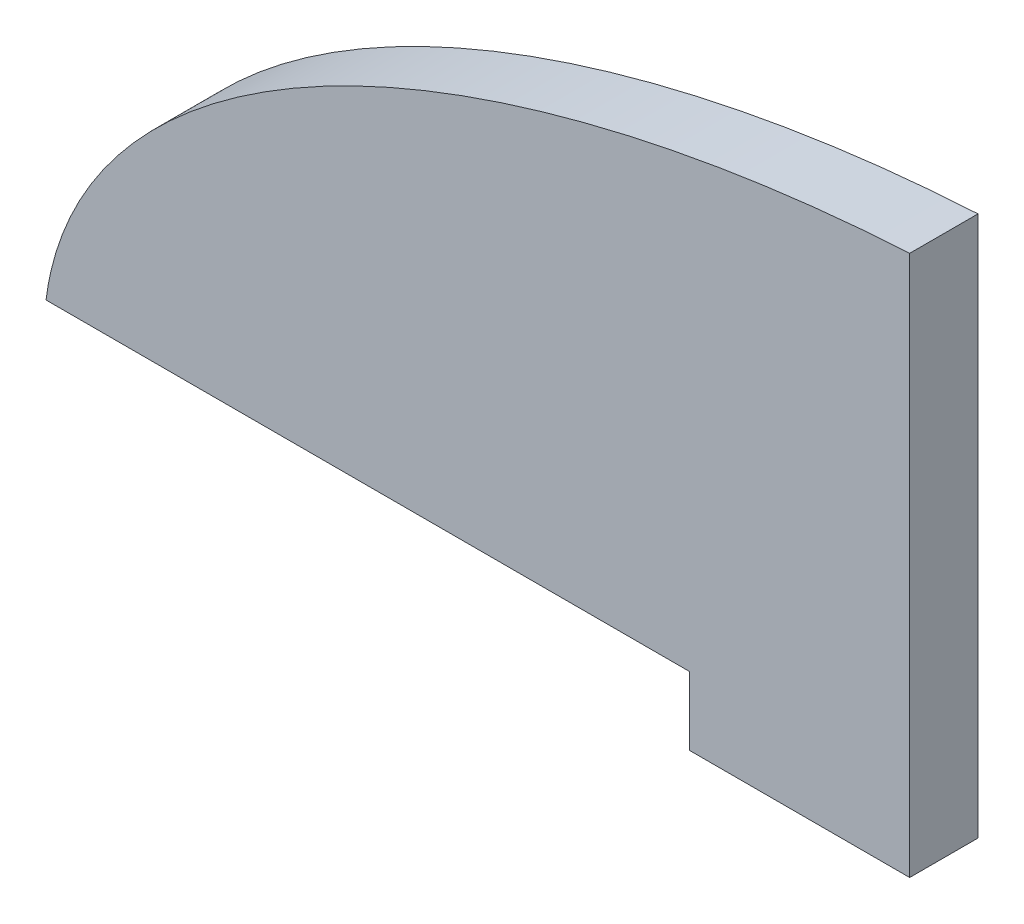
ISO-10303-21;
HEADER;
FILE_DESCRIPTION(('STEP AP214'),'2;1');
FILE_NAME('part.step','',(''),(''),'','','');
FILE_SCHEMA(('AUTOMOTIVE_DESIGN { 1 0 10303 214 1 1 1 1 }'));
ENDSEC;
DATA;
#1=APPLICATION_CONTEXT('core data for automotive mechanical design processes');
#2=APPLICATION_PROTOCOL_DEFINITION('international standard','automotive_design',2000,#1);
#3=PRODUCT_CONTEXT('',#1,'mechanical');
#4=PRODUCT('Part','Part','',(#3));
#5=PRODUCT_RELATED_PRODUCT_CATEGORY('part','',(#4));
#6=PRODUCT_DEFINITION_FORMATION('','',#4);
#7=PRODUCT_DEFINITION_CONTEXT('part definition',#1,'design');
#8=PRODUCT_DEFINITION('design','',#6,#7);
#9=PRODUCT_DEFINITION_SHAPE('','',#8);
#10=(LENGTH_UNIT() NAMED_UNIT(*) SI_UNIT(.MILLI.,.METRE.));
#11=(NAMED_UNIT(*) PLANE_ANGLE_UNIT() SI_UNIT($,.RADIAN.));
#12=(NAMED_UNIT(*) SI_UNIT($,.STERADIAN.) SOLID_ANGLE_UNIT());
#13=UNCERTAINTY_MEASURE_WITH_UNIT(LENGTH_MEASURE(1.E-05),#10,'distance_accuracy_value','');
#14=(GEOMETRIC_REPRESENTATION_CONTEXT(3) GLOBAL_UNCERTAINTY_ASSIGNED_CONTEXT((#13)) GLOBAL_UNIT_ASSIGNED_CONTEXT((#10,
#11,#12)) REPRESENTATION_CONTEXT('',''));
#15=CARTESIAN_POINT('',(0.,0.,0.));
#16=DIRECTION('',(0.,0.,1.));
#17=DIRECTION('',(1.,0.,0.));
#18=AXIS2_PLACEMENT_3D('',#15,#16,#17);
#19=CARTESIAN_POINT('',(0.,0.,3.175));
#20=DIRECTION('',(0.,0.,1.));
#21=DIRECTION('',(-1.,0.,0.));
#22=AXIS2_PLACEMENT_3D('',#19,#20,#21);
#23=ELLIPSE('',#22,45.,23.6670659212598);
#24=DIRECTION('',(0.,0.,-1.));
#25=VECTOR('',#24,1.);
#26=SURFACE_OF_LINEAR_EXTRUSION('',#23,#25);
#27=CARTESIAN_POINT('',(0.,0.,0.));
#28=DIRECTION('',(0.,0.,1.));
#29=DIRECTION('',(-1.,0.,0.));
#30=AXIS2_PLACEMENT_3D('',#27,#28,#29);
#31=ELLIPSE('',#30,45.,23.6670659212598);
#32=CARTESIAN_POINT('',(-4.7625,23.5341488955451,0.));
#33=VERTEX_POINT('',#32);
#34=CARTESIAN_POINT('',(-44.8986530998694,1.58750000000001,0.));
#35=VERTEX_POINT('',#34);
#36=EDGE_CURVE('E109',#33,#35,#31,.T.);
#37=ORIENTED_EDGE('',*,*,#36,.T.);
#38=DIRECTION('',(0.,0.,-1.));
#39=VECTOR('',#38,1.);
#40=CARTESIAN_POINT('',(-44.8986530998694,1.58750000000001,3.175));
#41=LINE('',#40,#39);
#42=CARTESIAN_POINT('',(-44.8986530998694,1.58750000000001,3.175));
#43=VERTEX_POINT('',#42);
#44=EDGE_CURVE('E11',#43,#35,#41,.T.);
#45=ORIENTED_EDGE('',*,*,#44,.F.);
#46=CARTESIAN_POINT('',(-4.7625,23.5341488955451,3.175));
#47=VERTEX_POINT('',#46);
#48=EDGE_CURVE('E118',#47,#43,#23,.T.);
#49=ORIENTED_EDGE('',*,*,#48,.F.);
#50=DIRECTION('',(0.,0.,-1.));
#51=VECTOR('',#50,1.);
#52=CARTESIAN_POINT('',(-4.7625,23.5341488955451,3.175));
#53=LINE('',#52,#51);
#54=EDGE_CURVE('E105',#47,#33,#53,.T.);
#55=ORIENTED_EDGE('',*,*,#54,.T.);
#56=EDGE_LOOP('',(#37,#45,#49,#55));
#57=FACE_BOUND('',#56,.T.);
#58=ADVANCED_FACE('F33',(#57),#26,.F.);
#59=CARTESIAN_POINT('',(-15.,1.5875,3.175));
#60=DIRECTION('',(0.,1.,0.));
#61=DIRECTION('',(-1.,0.,0.));
#62=AXIS2_PLACEMENT_3D('',#59,#60,#61);
#63=PLANE('',#62);
#64=DIRECTION('',(1.,0.,0.));
#65=VECTOR('',#64,1.);
#66=CARTESIAN_POINT('',(-15.,1.5875,0.));
#67=LINE('',#66,#65);
#68=CARTESIAN_POINT('',(-15.,1.5875,0.));
#69=VERTEX_POINT('',#68);
#70=EDGE_CURVE('E112',#35,#69,#67,.T.);
#71=ORIENTED_EDGE('',*,*,#70,.T.);
#72=DIRECTION('',(0.,0.,-1.));
#73=VECTOR('',#72,1.);
#74=CARTESIAN_POINT('',(-15.,1.5875,3.175));
#75=LINE('',#74,#73);
#76=CARTESIAN_POINT('',(-15.,1.5875,3.175));
#77=VERTEX_POINT('',#76);
#78=EDGE_CURVE('E42',#77,#69,#75,.T.);
#79=ORIENTED_EDGE('',*,*,#78,.F.);
#80=DIRECTION('',(1.,0.,0.));
#81=VECTOR('',#80,1.);
#82=CARTESIAN_POINT('',(-15.,1.5875,3.175));
#83=LINE('',#82,#81);
#84=EDGE_CURVE('E82',#43,#77,#83,.T.);
#85=ORIENTED_EDGE('',*,*,#84,.F.);
#86=ORIENTED_EDGE('',*,*,#44,.T.);
#87=EDGE_LOOP('',(#71,#79,#85,#86));
#88=FACE_BOUND('',#87,.T.);
#89=ADVANCED_FACE('F126',(#88),#63,.F.);
#90=CARTESIAN_POINT('',(-15.,-1.5875,3.175));
#91=DIRECTION('',(1.,0.,0.));
#92=DIRECTION('',(0.,0.,-1.));
#93=AXIS2_PLACEMENT_3D('',#90,#91,#92);
#94=PLANE('',#93);
#95=DIRECTION('',(0.,-1.,0.));
#96=VECTOR('',#95,1.);
#97=CARTESIAN_POINT('',(-15.,-1.5875,0.));
#98=LINE('',#97,#96);
#99=CARTESIAN_POINT('',(-15.,-1.5875,0.));
#100=VERTEX_POINT('',#99);
#101=EDGE_CURVE('E99',#69,#100,#98,.T.);
#102=ORIENTED_EDGE('',*,*,#101,.T.);
#103=DIRECTION('',(0.,0.,-1.));
#104=VECTOR('',#103,1.);
#105=CARTESIAN_POINT('',(-15.,-1.5875,3.175));
#106=LINE('',#105,#104);
#107=CARTESIAN_POINT('',(-15.,-1.5875,3.175));
#108=VERTEX_POINT('',#107);
#109=EDGE_CURVE('E96',#108,#100,#106,.T.);
#110=ORIENTED_EDGE('',*,*,#109,.F.);
#111=DIRECTION('',(0.,-1.,0.));
#112=VECTOR('',#111,1.);
#113=CARTESIAN_POINT('',(-15.,-1.5875,3.175));
#114=LINE('',#113,#112);
#115=EDGE_CURVE('E86',#77,#108,#114,.T.);
#116=ORIENTED_EDGE('',*,*,#115,.F.);
#117=ORIENTED_EDGE('',*,*,#78,.T.);
#118=EDGE_LOOP('',(#102,#110,#116,#117));
#119=FACE_BOUND('',#118,.T.);
#120=ADVANCED_FACE('F97',(#119),#94,.F.);
#121=CARTESIAN_POINT('',(-4.7625,-1.5875,3.175));
#122=DIRECTION('',(0.,1.,0.));
#123=DIRECTION('',(-1.,0.,0.));
#124=AXIS2_PLACEMENT_3D('',#121,#122,#123);
#125=PLANE('',#124);
#126=DIRECTION('',(1.,0.,0.));
#127=VECTOR('',#126,1.);
#128=CARTESIAN_POINT('',(-4.7625,-1.5875,0.));
#129=LINE('',#128,#127);
#130=CARTESIAN_POINT('',(-4.7625,-1.5875,0.));
#131=VERTEX_POINT('',#130);
#132=EDGE_CURVE('E115',#100,#131,#129,.T.);
#133=ORIENTED_EDGE('',*,*,#132,.T.);
#134=DIRECTION('',(0.,0.,-1.));
#135=VECTOR('',#134,1.);
#136=CARTESIAN_POINT('',(-4.7625,-1.5875,3.175));
#137=LINE('',#136,#135);
#138=CARTESIAN_POINT('',(-4.7625,-1.5875,3.175));
#139=VERTEX_POINT('',#138);
#140=EDGE_CURVE('E101',#139,#131,#137,.T.);
#141=ORIENTED_EDGE('',*,*,#140,.F.);
#142=DIRECTION('',(1.,0.,0.));
#143=VECTOR('',#142,1.);
#144=CARTESIAN_POINT('',(-4.7625,-1.5875,3.175));
#145=LINE('',#144,#143);
#146=EDGE_CURVE('E90',#108,#139,#145,.T.);
#147=ORIENTED_EDGE('',*,*,#146,.F.);
#148=ORIENTED_EDGE('',*,*,#109,.T.);
#149=EDGE_LOOP('',(#133,#141,#147,#148));
#150=FACE_BOUND('',#149,.T.);
#151=ADVANCED_FACE('F103',(#150),#125,.F.);
#152=CARTESIAN_POINT('',(-4.7625,0.,3.175));
#153=DIRECTION('',(-1.,0.,0.));
#154=DIRECTION('',(0.,0.,1.));
#155=AXIS2_PLACEMENT_3D('',#152,#153,#154);
#156=PLANE('',#155);
#157=DIRECTION('',(0.,1.,0.));
#158=VECTOR('',#157,1.);
#159=CARTESIAN_POINT('',(-4.7625,0.,0.));
#160=LINE('',#159,#158);
#161=EDGE_CURVE('E70',#131,#33,#160,.T.);
#162=ORIENTED_EDGE('',*,*,#161,.T.);
#163=ORIENTED_EDGE('',*,*,#54,.F.);
#164=DIRECTION('',(0.,1.,0.));
#165=VECTOR('',#164,1.);
#166=CARTESIAN_POINT('',(-4.7625,0.,3.175));
#167=LINE('',#166,#165);
#168=EDGE_CURVE('E50',#139,#47,#167,.T.);
#169=ORIENTED_EDGE('',*,*,#168,.F.);
#170=ORIENTED_EDGE('',*,*,#140,.T.);
#171=EDGE_LOOP('',(#162,#163,#169,#170));
#172=FACE_BOUND('',#171,.T.);
#173=ADVANCED_FACE('F121',(#172),#156,.F.);
#174=CARTESIAN_POINT('',(0.,0.,3.175));
#175=DIRECTION('',(0.,0.,1.));
#176=DIRECTION('',(1.,0.,0.));
#177=AXIS2_PLACEMENT_3D('',#174,#175,#176);
#178=PLANE('',#177);
#179=ORIENTED_EDGE('',*,*,#48,.T.);
#180=ORIENTED_EDGE('',*,*,#84,.T.);
#181=ORIENTED_EDGE('',*,*,#115,.T.);
#182=ORIENTED_EDGE('',*,*,#146,.T.);
#183=ORIENTED_EDGE('',*,*,#168,.T.);
#184=EDGE_LOOP('',(#179,#180,#181,#182,#183));
#185=FACE_BOUND('',#184,.T.);
#186=ADVANCED_FACE('F88',(#185),#178,.T.);
#187=CARTESIAN_POINT('',(0.,0.,0.));
#188=DIRECTION('',(0.,0.,1.));
#189=DIRECTION('',(1.,0.,0.));
#190=AXIS2_PLACEMENT_3D('',#187,#188,#189);
#191=PLANE('',#190);
#192=ORIENTED_EDGE('',*,*,#36,.F.);
#193=ORIENTED_EDGE('',*,*,#161,.F.);
#194=ORIENTED_EDGE('',*,*,#132,.F.);
#195=ORIENTED_EDGE('',*,*,#101,.F.);
#196=ORIENTED_EDGE('',*,*,#70,.F.);
#197=EDGE_LOOP('',(#192,#193,#194,#195,#196));
#198=FACE_BOUND('',#197,.T.);
#199=ADVANCED_FACE('F120',(#198),#191,.F.);
#200=CLOSED_SHELL('',(#58,#89,#120,#151,#173,#186,#199));
#201=MANIFOLD_SOLID_BREP('B2',#200);
#202=ADVANCED_BREP_SHAPE_REPRESENTATION('',(#18,#201),#14);
#203=SHAPE_DEFINITION_REPRESENTATION(#9,#202);
ENDSEC;
END-ISO-10303-21;
